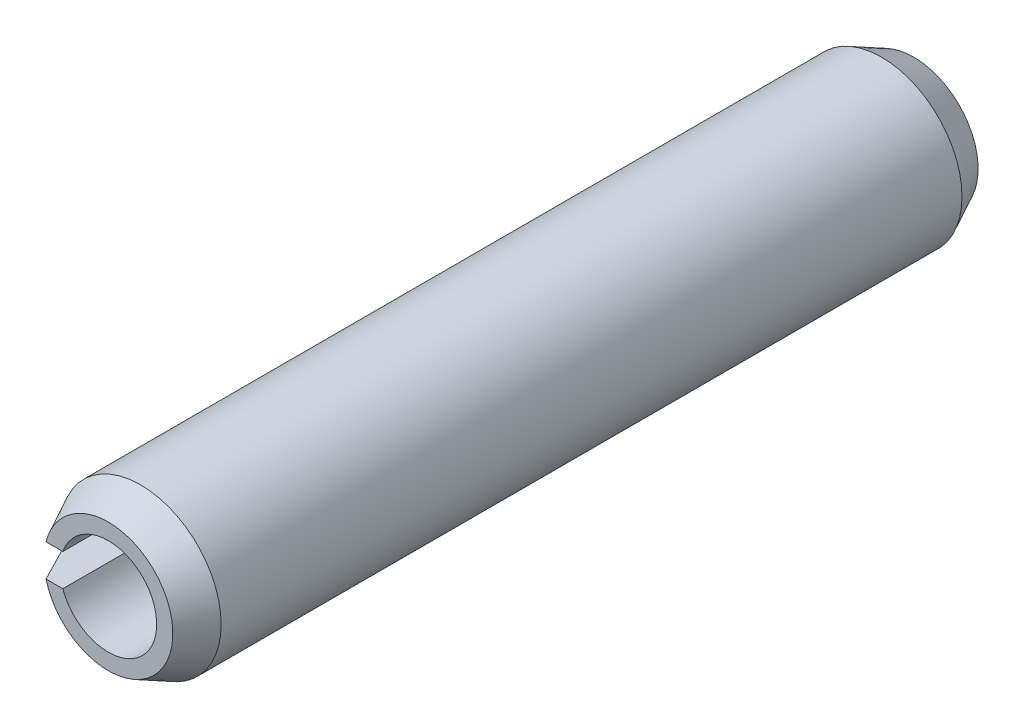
ISO-10303-21;
HEADER;
FILE_DESCRIPTION(('STEP AP214'),'2;1');
FILE_NAME('part.step','',(''),(''),'','','');
FILE_SCHEMA(('AUTOMOTIVE_DESIGN { 1 0 10303 214 1 1 1 1 }'));
ENDSEC;
DATA;
#1=APPLICATION_CONTEXT('core data for automotive mechanical design processes');
#2=APPLICATION_PROTOCOL_DEFINITION('international standard','automotive_design',2000,#1);
#3=PRODUCT_CONTEXT('',#1,'mechanical');
#4=PRODUCT('Part','Part','',(#3));
#5=PRODUCT_RELATED_PRODUCT_CATEGORY('part','',(#4));
#6=PRODUCT_DEFINITION_FORMATION('','',#4);
#7=PRODUCT_DEFINITION_CONTEXT('part definition',#1,'design');
#8=PRODUCT_DEFINITION('design','',#6,#7);
#9=PRODUCT_DEFINITION_SHAPE('','',#8);
#10=(LENGTH_UNIT() NAMED_UNIT(*) SI_UNIT(.MILLI.,.METRE.));
#11=(NAMED_UNIT(*) PLANE_ANGLE_UNIT() SI_UNIT($,.RADIAN.));
#12=(NAMED_UNIT(*) SI_UNIT($,.STERADIAN.) SOLID_ANGLE_UNIT());
#13=UNCERTAINTY_MEASURE_WITH_UNIT(LENGTH_MEASURE(1.E-05),#10,'distance_accuracy_value','');
#14=(GEOMETRIC_REPRESENTATION_CONTEXT(3) GLOBAL_UNCERTAINTY_ASSIGNED_CONTEXT((#13)) GLOBAL_UNIT_ASSIGNED_CONTEXT((#10,
#11,#12)) REPRESENTATION_CONTEXT('',''));
#15=CARTESIAN_POINT('',(0.,0.,0.));
#16=DIRECTION('',(0.,0.,1.));
#17=DIRECTION('',(1.,0.,0.));
#18=AXIS2_PLACEMENT_3D('',#15,#16,#17);
#19=CARTESIAN_POINT('',(0.,0.,50.));
#20=DIRECTION('',(0.,0.,-1.));
#21=DIRECTION('',(-1.,0.,0.));
#22=AXIS2_PLACEMENT_3D('',#19,#20,#21);
#23=CONICAL_SURFACE('',#22,4.,0.463647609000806);
#24=CARTESIAN_POINT('',(0.,0.,48.));
#25=DIRECTION('',(0.,0.,-1.));
#26=DIRECTION('',(-1.,0.,0.));
#27=AXIS2_PLACEMENT_3D('',#24,#25,#26);
#28=CIRCLE('',#27,5.);
#29=CARTESIAN_POINT('',(-4.89897948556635,1.,48.));
#30=VERTEX_POINT('',#29);
#31=CARTESIAN_POINT('',(-4.89897948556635,-1.,48.));
#32=VERTEX_POINT('',#31);
#33=EDGE_CURVE('E163',#30,#32,#28,.T.);
#34=ORIENTED_EDGE('',*,*,#33,.F.);
#35=CARTESIAN_POINT('',(-7.19920685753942,1.,43.4633457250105));
#36=CARTESIAN_POINT('',(-6.96576856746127,1.,43.9257530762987));
#37=CARTESIAN_POINT('',(-6.73218105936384,1.,44.3880853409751));
#38=CARTESIAN_POINT('',(-6.26454193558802,1.,45.3124995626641));
#39=CARTESIAN_POINT('',(-6.03049033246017,1.,45.7745815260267));
#40=CARTESIAN_POINT('',(-5.56177509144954,1.,46.6983602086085));
#41=CARTESIAN_POINT('',(-5.32711153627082,1.,47.160056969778));
#42=CARTESIAN_POINT('',(-4.85683817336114,1.,48.0829845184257));
#43=CARTESIAN_POINT('',(-4.6212283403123,1.,48.5442152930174));
#44=CARTESIAN_POINT('',(-4.26668268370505,1.,49.2355487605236));
#45=CARTESIAN_POINT('',(-4.14829859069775,1.,49.4659343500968));
#46=CARTESIAN_POINT('',(-3.91105336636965,1.,49.926458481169));
#47=CARTESIAN_POINT('',(-3.79219223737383,1.,50.1565970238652));
#48=CARTESIAN_POINT('',(-3.55385298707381,1.,50.6165345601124));
#49=CARTESIAN_POINT('',(-3.43437490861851,1.,50.846333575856));
#50=CARTESIAN_POINT('',(-3.19457347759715,1.,51.305495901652));
#51=CARTESIAN_POINT('',(-3.07425010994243,1.,51.5348592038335));
#52=CARTESIAN_POINT('',(-2.83239517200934,1.,51.9930185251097));
#53=CARTESIAN_POINT('',(-2.71086331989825,1.,52.2218143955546));
#54=CARTESIAN_POINT('',(-2.46609199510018,1.,52.6784799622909));
#55=CARTESIAN_POINT('',(-2.3428526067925,1.,52.9063497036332));
#56=CARTESIAN_POINT('',(-2.15596872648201,1.,53.2470833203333));
#57=CARTESIAN_POINT('',(-2.09332833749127,1.,53.3604974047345));
#58=CARTESIAN_POINT('',(-1.96717538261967,1.,53.5868365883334));
#59=CARTESIAN_POINT('',(-1.90366283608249,1.,53.6997616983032));
#60=CARTESIAN_POINT('',(-1.77549442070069,1.,53.9249895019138));
#61=CARTESIAN_POINT('',(-1.71083835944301,1.,54.0372920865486));
#62=CARTESIAN_POINT('',(-1.57993262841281,1.,54.2609746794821));
#63=CARTESIAN_POINT('',(-1.51368283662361,1.,54.3723546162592));
#64=CARTESIAN_POINT('',(-1.44641069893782,1.,54.4831241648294));
#65=B_SPLINE_CURVE_WITH_KNOTS('',3,(#35,#36,#37,#38,#39,#40,#41,#42,#43,#44,#45,#46,#47,#48,#49,
#50,#51,#52,#53,#54,#55,#56,#57,#58,#59,#60,#61,#62,#63,#64),.UNSPECIFIED.,.F.,.F.,(4,2,2,2,2,2,
2,2,2,2,2,2,2,2,4),(0.,1.55397133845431,3.1079012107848,4.66163095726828,6.21540255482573,
6.99246767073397,7.76952900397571,8.54653707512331,9.3235590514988,10.1007666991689,
10.8779360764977,11.2666220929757,11.6552995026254,12.044042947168,12.4328162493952),.UNSPECIFIED.);
#66=CARTESIAN_POINT('',(-3.87298334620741,1.,50.));
#67=VERTEX_POINT('',#66);
#68=EDGE_CURVE('E53',#30,#67,#65,.T.);
#69=ORIENTED_EDGE('',*,*,#68,.T.);
#70=CARTESIAN_POINT('',(0.,0.,50.));
#71=DIRECTION('',(0.,0.,-1.));
#72=DIRECTION('',(-1.,0.,0.));
#73=AXIS2_PLACEMENT_3D('',#70,#71,#72);
#74=CIRCLE('',#73,4.);
#75=CARTESIAN_POINT('',(-3.87298334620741,-1.,50.));
#76=VERTEX_POINT('',#75);
#77=EDGE_CURVE('E144',#67,#76,#74,.T.);
#78=ORIENTED_EDGE('',*,*,#77,.T.);
#79=CARTESIAN_POINT('',(-1.44641069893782,-1.,54.4831241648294));
#80=CARTESIAN_POINT('',(-1.49903961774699,-1.,54.3965019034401));
#81=CARTESIAN_POINT('',(-1.55102597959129,-1.,54.3094939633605));
#82=CARTESIAN_POINT('',(-1.65395647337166,-1.,54.134869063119));
#83=CARTESIAN_POINT('',(-1.7049006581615,-1.,54.0472521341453));
#84=CARTESIAN_POINT('',(-1.80598802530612,-1.,53.8715748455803));
#85=CARTESIAN_POINT('',(-1.85613131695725,-1.,53.7835145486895));
#86=CARTESIAN_POINT('',(-1.95578026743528,-1.,53.6070325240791));
#87=CARTESIAN_POINT('',(-2.00528591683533,-1.,53.5186107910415));
#88=CARTESIAN_POINT('',(-2.15301103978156,-1.,53.2529638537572));
#89=CARTESIAN_POINT('',(-2.25046400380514,-1.,53.0753125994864));
#90=CARTESIAN_POINT('',(-2.44397565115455,-1.,52.7192449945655));
#91=CARTESIAN_POINT('',(-2.54003427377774,-1.,52.540828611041));
#92=CARTESIAN_POINT('',(-2.78434813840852,-1.,52.0839919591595));
#93=CARTESIAN_POINT('',(-2.93189222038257,-1.,51.8051916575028));
#94=CARTESIAN_POINT('',(-3.22544724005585,-1.,51.2467846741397));
#95=CARTESIAN_POINT('',(-3.37145816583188,-1.,50.9671779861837));
#96=CARTESIAN_POINT('',(-3.66245685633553,-1.,50.4073701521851));
#97=CARTESIAN_POINT('',(-3.80744443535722,-1.,50.1271689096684));
#98=CARTESIAN_POINT('',(-4.09667321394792,-1.,49.5663813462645));
#99=CARTESIAN_POINT('',(-4.24091441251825,-1.,49.2857950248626));
#100=CARTESIAN_POINT('',(-4.62128606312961,-1.,48.544102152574));
#101=CARTESIAN_POINT('',(-4.85695365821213,-1.,48.0827583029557));
#102=CARTESIAN_POINT('',(-5.32734831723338,-1.,47.1595918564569));
#103=CARTESIAN_POINT('',(-5.56207538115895,-1.,46.6977692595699));
#104=CARTESIAN_POINT('',(-6.0307964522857,-1.,45.7739773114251));
#105=CARTESIAN_POINT('',(-6.26479070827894,-1.,45.3120080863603));
#106=CARTESIAN_POINT('',(-6.73230865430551,-1.,44.387832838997));
#107=CARTESIAN_POINT('',(-6.96583234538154,-1.,43.925626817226));
#108=CARTESIAN_POINT('',(-7.19920685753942,-1.,43.4633457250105));
#109=B_SPLINE_CURVE_WITH_KNOTS('',3,(#79,#80,#81,#82,#83,#84,#85,#86,#87,#88,#89,#90,#91,#92,
#93,#94,#95,#96,#97,#98,#99,#100,#101,#102,#103,#104,#105,#106,#107,#108),.UNSPECIFIED.,.F.,.F.,
(4,2,2,2,2,2,2,2,2,2,2,2,2,2,4),(0.,0.304062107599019,0.608108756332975,0.912113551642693,
1.21612283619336,1.82398831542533,2.43188017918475,3.37817456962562,4.32447631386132,
5.27094558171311,6.21741611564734,7.77156868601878,9.32572127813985,10.8792716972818,
12.4328186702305),.UNSPECIFIED.);
#110=EDGE_CURVE('E122',#76,#32,#109,.T.);
#111=ORIENTED_EDGE('',*,*,#110,.T.);
#112=EDGE_LOOP('',(#34,#69,#78,#111));
#113=FACE_BOUND('',#112,.T.);
#114=ADVANCED_FACE('F32',(#113),#23,.T.);
#115=CARTESIAN_POINT('',(0.,0.,0.));
#116=DIRECTION('',(0.,0.,-1.));
#117=DIRECTION('',(-1.,0.,0.));
#118=AXIS2_PLACEMENT_3D('',#115,#116,#117);
#119=CYLINDRICAL_SURFACE('',#118,5.);
#120=CARTESIAN_POINT('',(0.,0.,2.));
#121=DIRECTION('',(0.,0.,-1.));
#122=DIRECTION('',(-1.,0.,0.));
#123=AXIS2_PLACEMENT_3D('',#120,#121,#122);
#124=CIRCLE('',#123,5.);
#125=CARTESIAN_POINT('',(-4.89897948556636,1.,2.));
#126=VERTEX_POINT('',#125);
#127=CARTESIAN_POINT('',(-4.89897948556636,-1.,2.));
#128=VERTEX_POINT('',#127);
#129=EDGE_CURVE('E160',#126,#128,#124,.T.);
#130=ORIENTED_EDGE('',*,*,#129,.F.);
#131=DIRECTION('',(0.,0.,-1.));
#132=VECTOR('',#131,1.);
#133=CARTESIAN_POINT('',(-4.89897948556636,1.,0.));
#134=LINE('',#133,#132);
#135=EDGE_CURVE('E57',#126,#30,#134,.F.);
#136=ORIENTED_EDGE('',*,*,#135,.T.);
#137=ORIENTED_EDGE('',*,*,#33,.T.);
#138=DIRECTION('',(0.,0.,-1.));
#139=VECTOR('',#138,1.);
#140=CARTESIAN_POINT('',(-4.89897948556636,-1.,0.));
#141=LINE('',#140,#139);
#142=EDGE_CURVE('E103',#32,#128,#141,.T.);
#143=ORIENTED_EDGE('',*,*,#142,.T.);
#144=EDGE_LOOP('',(#130,#136,#137,#143));
#145=FACE_BOUND('',#144,.T.);
#146=ADVANCED_FACE('F149',(#145),#119,.T.);
#147=CARTESIAN_POINT('',(0.,0.,2.));
#148=DIRECTION('',(0.,0.,1.));
#149=DIRECTION('',(1.,0.,0.));
#150=AXIS2_PLACEMENT_3D('',#147,#148,#149);
#151=CONICAL_SURFACE('',#150,5.,0.463647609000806);
#152=CARTESIAN_POINT('',(0.,0.,0.));
#153=DIRECTION('',(0.,0.,-1.));
#154=DIRECTION('',(-1.,0.,0.));
#155=AXIS2_PLACEMENT_3D('',#152,#153,#154);
#156=CIRCLE('',#155,4.);
#157=CARTESIAN_POINT('',(-3.87298334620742,1.,0.));
#158=VERTEX_POINT('',#157);
#159=CARTESIAN_POINT('',(-3.87298334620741,-1.,0.));
#160=VERTEX_POINT('',#159);
#161=EDGE_CURVE('E164',#158,#160,#156,.T.);
#162=ORIENTED_EDGE('',*,*,#161,.F.);
#163=CARTESIAN_POINT('',(-1.44641069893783,1.,-4.48312416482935));
#164=CARTESIAN_POINT('',(-1.49903961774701,1.,-4.39650190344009));
#165=CARTESIAN_POINT('',(-1.55102597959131,1.,-4.30949396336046));
#166=CARTESIAN_POINT('',(-1.65395647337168,1.,-4.13486906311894));
#167=CARTESIAN_POINT('',(-1.70490065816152,1.,-4.04725213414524));
#168=CARTESIAN_POINT('',(-1.80598802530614,1.,-3.87157484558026));
#169=CARTESIAN_POINT('',(-1.85613131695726,1.,-3.7835145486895));
#170=CARTESIAN_POINT('',(-1.95578026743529,1.,-3.60703252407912));
#171=CARTESIAN_POINT('',(-2.00528591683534,1.,-3.51861079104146));
#172=CARTESIAN_POINT('',(-2.15301103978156,1.,-3.25296385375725));
#173=CARTESIAN_POINT('',(-2.25046400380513,1.,-3.07531259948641));
#174=CARTESIAN_POINT('',(-2.44397565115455,1.,-2.71924499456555));
#175=CARTESIAN_POINT('',(-2.54003427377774,1.,-2.54082861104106));
#176=CARTESIAN_POINT('',(-2.78434813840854,1.,-2.08399195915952));
#177=CARTESIAN_POINT('',(-2.93189222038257,1.,-1.8051916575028));
#178=CARTESIAN_POINT('',(-3.22544724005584,1.,-1.24678467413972));
#179=CARTESIAN_POINT('',(-3.37145816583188,1.,-0.967177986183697));
#180=CARTESIAN_POINT('',(-3.66245685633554,1.,-0.407370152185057));
#181=CARTESIAN_POINT('',(-3.80744443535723,1.,-0.127168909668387));
#182=CARTESIAN_POINT('',(-4.09667321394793,1.,0.433618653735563));
#183=CARTESIAN_POINT('',(-4.24091441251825,1.,0.714204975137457));
#184=CARTESIAN_POINT('',(-4.6212860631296,1.,1.455897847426));
#185=CARTESIAN_POINT('',(-4.85695365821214,1.,1.91724169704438));
#186=CARTESIAN_POINT('',(-5.32734831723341,1.,2.84040814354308));
#187=CARTESIAN_POINT('',(-5.56207538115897,1.,3.3022307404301));
#188=CARTESIAN_POINT('',(-6.03079645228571,1.,4.22602268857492));
#189=CARTESIAN_POINT('',(-6.26479070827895,1.,4.6879919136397));
#190=CARTESIAN_POINT('',(-6.73230865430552,1.,5.61216716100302));
#191=CARTESIAN_POINT('',(-6.96583234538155,1.,6.07437318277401));
#192=CARTESIAN_POINT('',(-7.19920685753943,1.,6.53665427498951));
#193=B_SPLINE_CURVE_WITH_KNOTS('',3,(#163,#164,#165,#166,#167,#168,#169,#170,#171,#172,#173,
#174,#175,#176,#177,#178,#179,#180,#181,#182,#183,#184,#185,#186,#187,#188,#189,#190,#191,#192),
.UNSPECIFIED.,.F.,.F.,(4,2,2,2,2,2,2,2,2,2,2,2,2,2,4),(0.,0.304062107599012,0.608108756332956,
0.912113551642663,1.21612283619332,1.82398831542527,2.43188017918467,3.37817456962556,
4.32447631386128,5.27094558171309,6.21741611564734,7.77156868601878,9.32572127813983,
10.8792716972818,12.4328186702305),.UNSPECIFIED.);
#194=EDGE_CURVE('E11',#158,#126,#193,.T.);
#195=ORIENTED_EDGE('',*,*,#194,.T.);
#196=ORIENTED_EDGE('',*,*,#129,.T.);
#197=CARTESIAN_POINT('',(-7.19920685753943,-1.,6.53665427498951));
#198=CARTESIAN_POINT('',(-6.96576856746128,-1.,6.07424692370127));
#199=CARTESIAN_POINT('',(-6.73218105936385,-1.,5.61191465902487));
#200=CARTESIAN_POINT('',(-6.26454193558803,-1.,4.6875004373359));
#201=CARTESIAN_POINT('',(-6.03049033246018,-1.,4.22541847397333));
#202=CARTESIAN_POINT('',(-5.56177509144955,-1.,3.30163979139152));
#203=CARTESIAN_POINT('',(-5.32711153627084,-1.,2.83994303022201));
#204=CARTESIAN_POINT('',(-4.85683817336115,-1.,1.91701548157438));
#205=CARTESIAN_POINT('',(-4.62122834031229,-1.,1.45578470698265));
#206=CARTESIAN_POINT('',(-4.26668268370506,-1.,0.764451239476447));
#207=CARTESIAN_POINT('',(-4.14829859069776,-1.,0.534065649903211));
#208=CARTESIAN_POINT('',(-3.91105336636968,-1.,0.0735415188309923));
#209=CARTESIAN_POINT('',(-3.79219223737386,-1.,-0.156597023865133));
#210=CARTESIAN_POINT('',(-3.55385298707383,-1.,-0.616534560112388));
#211=CARTESIAN_POINT('',(-3.43437490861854,-1.,-0.846333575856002));
#212=CARTESIAN_POINT('',(-3.19457347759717,-1.,-1.30549590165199));
#213=CARTESIAN_POINT('',(-3.07425010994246,-1.,-1.53485920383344));
#214=CARTESIAN_POINT('',(-2.83239517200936,-1.,-1.99301852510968));
#215=CARTESIAN_POINT('',(-2.71086331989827,-1.,-2.22181439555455));
#216=CARTESIAN_POINT('',(-2.4660919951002,-1.,-2.67847996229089));
#217=CARTESIAN_POINT('',(-2.34285260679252,-1.,-2.90634970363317));
#218=CARTESIAN_POINT('',(-2.15596872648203,-1.,-3.24708332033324));
#219=CARTESIAN_POINT('',(-2.09332833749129,-1.,-3.36049740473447));
#220=CARTESIAN_POINT('',(-1.96717538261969,-1.,-3.58683658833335));
#221=CARTESIAN_POINT('',(-1.90366283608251,-1.,-3.69976169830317));
#222=CARTESIAN_POINT('',(-1.77549442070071,-1.,-3.92498950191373));
#223=CARTESIAN_POINT('',(-1.71083835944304,-1.,-4.03729208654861));
#224=CARTESIAN_POINT('',(-1.57993262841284,-1.,-4.2609746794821));
#225=CARTESIAN_POINT('',(-1.51368283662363,-1.,-4.37235461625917));
#226=CARTESIAN_POINT('',(-1.44641069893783,-1.,-4.48312416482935));
#227=B_SPLINE_CURVE_WITH_KNOTS('',3,(#197,#198,#199,#200,#201,#202,#203,#204,#205,#206,#207,
#208,#209,#210,#211,#212,#213,#214,#215,#216,#217,#218,#219,#220,#221,#222,#223,#224,#225,#226),
.UNSPECIFIED.,.F.,.F.,(4,2,2,2,2,2,2,2,2,2,2,2,2,2,4),(0.,1.55397133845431,3.10790121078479,
4.66163095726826,6.2154025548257,6.99246767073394,7.76952900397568,8.54653707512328,
9.32355905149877,10.1007666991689,10.8779360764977,11.2666220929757,11.6552995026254,
12.044042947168,12.4328162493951),.UNSPECIFIED.);
#228=EDGE_CURVE('E46',#128,#160,#227,.T.);
#229=ORIENTED_EDGE('',*,*,#228,.T.);
#230=EDGE_LOOP('',(#162,#195,#196,#229));
#231=FACE_BOUND('',#230,.T.);
#232=ADVANCED_FACE('F146',(#231),#151,.T.);
#233=CARTESIAN_POINT('',(-6.,1.,50.));
#234=DIRECTION('',(0.,1.,0.));
#235=DIRECTION('',(0.,0.,-1.));
#236=AXIS2_PLACEMENT_3D('',#233,#234,#235);
#237=PLANE('',#236);
#238=ORIENTED_EDGE('',*,*,#194,.F.);
#239=DIRECTION('',(1.,0.,0.));
#240=VECTOR('',#239,1.);
#241=CARTESIAN_POINT('',(-3.87298334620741,1.,0.));
#242=LINE('',#241,#240);
#243=CARTESIAN_POINT('',(-2.82842712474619,0.999999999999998,0.));
#244=VERTEX_POINT('',#243);
#245=EDGE_CURVE('E87',#158,#244,#242,.T.);
#246=ORIENTED_EDGE('',*,*,#245,.T.);
#247=DIRECTION('',(0.,0.,-1.));
#248=VECTOR('',#247,1.);
#249=CARTESIAN_POINT('',(-2.82842712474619,0.999999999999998,50.));
#250=LINE('',#249,#248);
#251=CARTESIAN_POINT('',(-2.82842712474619,0.999999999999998,50.));
#252=VERTEX_POINT('',#251);
#253=EDGE_CURVE('E90',#252,#244,#250,.T.);
#254=ORIENTED_EDGE('',*,*,#253,.F.);
#255=DIRECTION('',(1.,0.,0.));
#256=VECTOR('',#255,1.);
#257=CARTESIAN_POINT('',(-3.87298334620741,1.,50.));
#258=LINE('',#257,#256);
#259=EDGE_CURVE('E111',#67,#252,#258,.T.);
#260=ORIENTED_EDGE('',*,*,#259,.F.);
#261=ORIENTED_EDGE('',*,*,#68,.F.);
#262=ORIENTED_EDGE('',*,*,#135,.F.);
#263=EDGE_LOOP('',(#238,#246,#254,#260,#261,#262));
#264=FACE_BOUND('',#263,.T.);
#265=ADVANCED_FACE('F89',(#264),#237,.F.);
#266=CARTESIAN_POINT('',(0.,-1.,50.));
#267=DIRECTION('',(0.,-1.,0.));
#268=DIRECTION('',(0.,0.,1.));
#269=AXIS2_PLACEMENT_3D('',#266,#267,#268);
#270=PLANE('',#269);
#271=ORIENTED_EDGE('',*,*,#110,.F.);
#272=DIRECTION('',(-1.,0.,0.));
#273=VECTOR('',#272,1.);
#274=CARTESIAN_POINT('',(-2.82842712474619,-1.,50.));
#275=LINE('',#274,#273);
#276=CARTESIAN_POINT('',(-2.82842712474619,-1.,50.));
#277=VERTEX_POINT('',#276);
#278=EDGE_CURVE('E116',#277,#76,#275,.T.);
#279=ORIENTED_EDGE('',*,*,#278,.F.);
#280=DIRECTION('',(0.,0.,-1.));
#281=VECTOR('',#280,1.);
#282=CARTESIAN_POINT('',(-2.82842712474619,-1.,50.));
#283=LINE('',#282,#281);
#284=CARTESIAN_POINT('',(-2.82842712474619,-1.,0.));
#285=VERTEX_POINT('',#284);
#286=EDGE_CURVE('E104',#277,#285,#283,.T.);
#287=ORIENTED_EDGE('',*,*,#286,.T.);
#288=DIRECTION('',(-1.,0.,0.));
#289=VECTOR('',#288,1.);
#290=CARTESIAN_POINT('',(-2.82842712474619,-1.,0.));
#291=LINE('',#290,#289);
#292=EDGE_CURVE('E109',#285,#160,#291,.T.);
#293=ORIENTED_EDGE('',*,*,#292,.T.);
#294=ORIENTED_EDGE('',*,*,#228,.F.);
#295=ORIENTED_EDGE('',*,*,#142,.F.);
#296=EDGE_LOOP('',(#271,#279,#287,#293,#294,#295));
#297=FACE_BOUND('',#296,.T.);
#298=ADVANCED_FACE('F131',(#297),#270,.F.);
#299=CARTESIAN_POINT('',(0.,0.,50.));
#300=DIRECTION('',(0.,0.,-1.));
#301=DIRECTION('',(-1.,0.,0.));
#302=AXIS2_PLACEMENT_3D('',#299,#300,#301);
#303=CYLINDRICAL_SURFACE('',#302,3.);
#304=CARTESIAN_POINT('',(0.,0.,0.));
#305=DIRECTION('',(0.,0.,-1.));
#306=DIRECTION('',(1.,0.,0.));
#307=AXIS2_PLACEMENT_3D('',#304,#305,#306);
#308=CIRCLE('',#307,3.);
#309=EDGE_CURVE('E96',#244,#285,#308,.T.);
#310=ORIENTED_EDGE('',*,*,#309,.T.);
#311=ORIENTED_EDGE('',*,*,#286,.F.);
#312=CARTESIAN_POINT('',(0.,0.,50.));
#313=DIRECTION('',(0.,0.,-1.));
#314=DIRECTION('',(1.,0.,0.));
#315=AXIS2_PLACEMENT_3D('',#312,#313,#314);
#316=CIRCLE('',#315,3.);
#317=EDGE_CURVE('E102',#252,#277,#316,.T.);
#318=ORIENTED_EDGE('',*,*,#317,.F.);
#319=ORIENTED_EDGE('',*,*,#253,.T.);
#320=EDGE_LOOP('',(#310,#311,#318,#319));
#321=FACE_BOUND('',#320,.T.);
#322=ADVANCED_FACE('F99',(#321),#303,.F.);
#323=CARTESIAN_POINT('',(0.,0.,50.));
#324=DIRECTION('',(0.,0.,1.));
#325=DIRECTION('',(1.,0.,0.));
#326=AXIS2_PLACEMENT_3D('',#323,#324,#325);
#327=PLANE('',#326);
#328=ORIENTED_EDGE('',*,*,#77,.F.);
#329=ORIENTED_EDGE('',*,*,#259,.T.);
#330=ORIENTED_EDGE('',*,*,#317,.T.);
#331=ORIENTED_EDGE('',*,*,#278,.T.);
#332=EDGE_LOOP('',(#328,#329,#330,#331));
#333=FACE_BOUND('',#332,.T.);
#334=ADVANCED_FACE('F174',(#333),#327,.T.);
#335=CARTESIAN_POINT('',(0.,0.,0.));
#336=DIRECTION('',(0.,0.,1.));
#337=DIRECTION('',(1.,0.,0.));
#338=AXIS2_PLACEMENT_3D('',#335,#336,#337);
#339=PLANE('',#338);
#340=ORIENTED_EDGE('',*,*,#161,.T.);
#341=ORIENTED_EDGE('',*,*,#292,.F.);
#342=ORIENTED_EDGE('',*,*,#309,.F.);
#343=ORIENTED_EDGE('',*,*,#245,.F.);
#344=EDGE_LOOP('',(#340,#341,#342,#343));
#345=FACE_BOUND('',#344,.T.);
#346=ADVANCED_FACE('F107',(#345),#339,.F.);
#347=CLOSED_SHELL('',(#114,#146,#232,#265,#298,#322,#334,#346));
#348=MANIFOLD_SOLID_BREP('B2',#347);
#349=ADVANCED_BREP_SHAPE_REPRESENTATION('',(#18,#348),#14);
#350=SHAPE_DEFINITION_REPRESENTATION(#9,#349);
ENDSEC;
END-ISO-10303-21;
